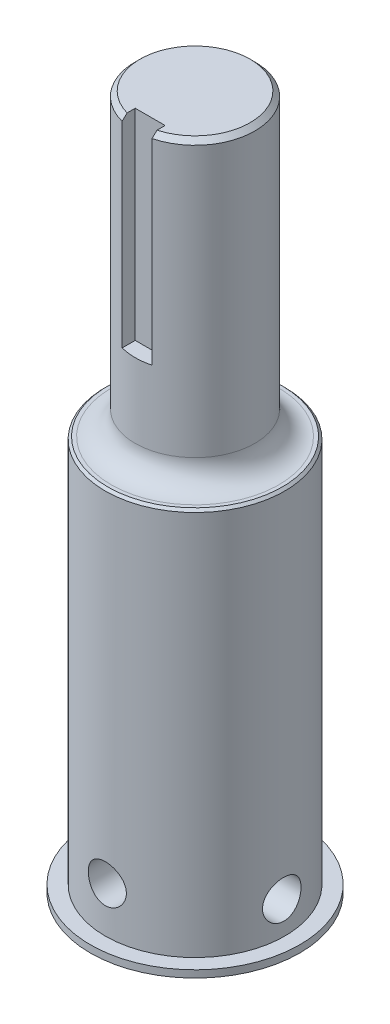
from build123d import *

# Parameters (mm, degrees)
SKETCH1_R                   = 11.1125
EXTRUDE1_DEPTH              = 41.91
SKETCH2_R                   = 6.00075
CUT_EXTRUDE1_DEPTH          = 25.4
CHAMFER1_SIZE               = 0.254
SKETCH10_R                  = 11.685204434
SKETCH10_R_2                = 9.525
CUT_EXTRUDE2_DEPTH          = 45.046943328
SKETCH3_R                   = 6.35
EXTRUDE2_DEPTH              = 31.75
FILLET1_R                   = 2.54
CHAMFER2_SIZE               = 0.254
CHAMFER3_SIZE               = 0.508
F_10_32_TAPPED_HOLE1_REACH  = 75.785
F_10_32_TAPPED_HOLE1_BORE_R = 2.0193
F_10_32_TAPPED_HOLE2_D      = 4.0386
F_10_32_TAPPED_HOLE2_DEPTH  = 9.525
SKETCH11_W                  = 3.175
SKETCH11_H                  = 21.336
CUT_EXTRUDE3_DEPTH          = 77.166258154


with BuildPart() as part:
    # Sketch1 → Extrude1 (new body)
    with BuildSketch(Plane(origin=(0, 0, 0), x_dir=(1, 0, 0), z_dir=(0, 1, 0))):
        with Locations(Location((0, 0, 0), (0, 0, 270))):
            Circle(SKETCH1_R)
    extrude(amount=EXTRUDE1_DEPTH)

    # Sketch2 → Cut-Extrude1 (cut)
    with BuildSketch(Plane.XZ):
        with Locations(Location((0, 0, 0), (0, 0, 270))):
            Circle(SKETCH2_R)
    extrude(amount=-CUT_EXTRUDE1_DEPTH, mode=Mode.SUBTRACT)

    # Chamfer1
    chamfer1_edges = [part.edges().sort_by_distance(p)[0] for p in [
        (0, 0, 6.00075),
    ]]
    chamfer(chamfer1_edges, length=CHAMFER1_SIZE)

    # Sketch10 → Cut-Extrude2 (cut, through all)
    with BuildSketch(Plane.XZ.offset(-0.762)):
        Circle(SKETCH10_R)
        with Locations(Location((0, 0, 0), (0, 0, 270))):
            Circle(SKETCH10_R_2, mode=Mode.SUBTRACT)
    extrude(amount=-CUT_EXTRUDE2_DEPTH, mode=Mode.SUBTRACT)

    # Sketch3 → Extrude2 (add)
    with BuildSketch(Plane(origin=(0, 41.91, 0), x_dir=(-1, 0, 0), z_dir=(0, 1, 0))):
        with Locations(Location((0, 0, 0), (0, 0, 90))):
            Circle(SKETCH3_R)
    extrude(amount=EXTRUDE2_DEPTH)

    # Fillet1
    fillet1_edges = [part.edges().sort_by_distance(p)[0] for p in [
        (0, 41.91, -6.35),
    ]]
    fillet(fillet1_edges, radius=FILLET1_R)

    # Chamfer2
    chamfer2_edges = [part.edges().sort_by_distance(p)[0] for p in [
        (0, 41.91, 9.525),
    ]]
    chamfer(chamfer2_edges, length=CHAMFER2_SIZE)

    # Chamfer3
    chamfer3_edges = [part.edges().sort_by_distance(p)[0] for p in [
        (0, 73.66, -6.35),
    ]]
    chamfer(chamfer3_edges, length=CHAMFER3_SIZE)

    # 10-32 Tapped Hole1 bore (on position points) → 10-32 Tapped Hole1 (cut, up to next)
    with BuildSketch(Plane(origin=(11.111736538, 4.205909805, 0.130258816), x_dir=(-0.011721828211, 0, 0.999931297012), z_dir=(0.999931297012, 0, 0.011721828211)), mode=Mode.PRIVATE) as f_10_32_tapped_hole1_sk1:
        Circle(F_10_32_TAPPED_HOLE1_BORE_R)
    f_10_32_tapped_hole1_tool1 = extrude(f_10_32_tapped_hole1_sk1.sketch, amount=-F_10_32_TAPPED_HOLE1_REACH, mode=Mode.PRIVATE) & part.part
    add(f_10_32_tapped_hole1_tool1.solids().sort_by_distance((11.111737, 4.20591, 0.130259))[0], mode=Mode.SUBTRACT)

    # 10-32 Tapped Hole2
    with Locations(Plane.XY.offset(9.525)):
        with Locations((0, 5.588)):
            Hole(F_10_32_TAPPED_HOLE2_D / 2, depth=F_10_32_TAPPED_HOLE2_DEPTH)

    # Sketch11 → Cut-Extrude3 (cut, through all)
    with BuildSketch(Plane.XY.offset(4.7625)):
        with Locations((0, 62.992)):
            Rectangle(SKETCH11_W, SKETCH11_H)
    extrude(amount=CUT_EXTRUDE3_DEPTH, mode=Mode.SUBTRACT)


solid = part.part
